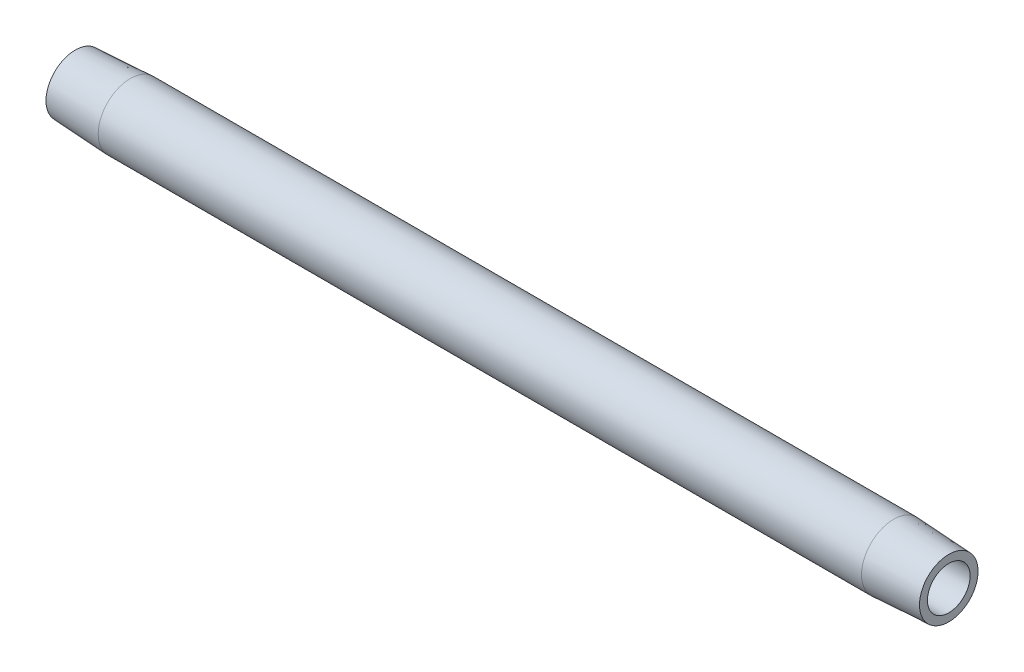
ISO-10303-21;
HEADER;
FILE_DESCRIPTION(('STEP AP214'),'2;1');
FILE_NAME('part.step','',(''),(''),'','','');
FILE_SCHEMA(('AUTOMOTIVE_DESIGN { 1 0 10303 214 1 1 1 1 }'));
ENDSEC;
DATA;
#1=APPLICATION_CONTEXT('core data for automotive mechanical design processes');
#2=APPLICATION_PROTOCOL_DEFINITION('international standard','automotive_design',2000,#1);
#3=PRODUCT_CONTEXT('',#1,'mechanical');
#4=PRODUCT('Part','Part','',(#3));
#5=PRODUCT_RELATED_PRODUCT_CATEGORY('part','',(#4));
#6=PRODUCT_DEFINITION_FORMATION('','',#4);
#7=PRODUCT_DEFINITION_CONTEXT('part definition',#1,'design');
#8=PRODUCT_DEFINITION('design','',#6,#7);
#9=PRODUCT_DEFINITION_SHAPE('','',#8);
#10=(LENGTH_UNIT() NAMED_UNIT(*) SI_UNIT(.MILLI.,.METRE.));
#11=(NAMED_UNIT(*) PLANE_ANGLE_UNIT() SI_UNIT($,.RADIAN.));
#12=(NAMED_UNIT(*) SI_UNIT($,.STERADIAN.) SOLID_ANGLE_UNIT());
#13=UNCERTAINTY_MEASURE_WITH_UNIT(LENGTH_MEASURE(1.E-05),#10,'distance_accuracy_value','');
#14=(GEOMETRIC_REPRESENTATION_CONTEXT(3) GLOBAL_UNCERTAINTY_ASSIGNED_CONTEXT((#13)) GLOBAL_UNIT_ASSIGNED_CONTEXT((#10,
#11,#12)) REPRESENTATION_CONTEXT('',''));
#15=CARTESIAN_POINT('',(0.,0.,0.));
#16=DIRECTION('',(0.,0.,1.));
#17=DIRECTION('',(1.,0.,0.));
#18=AXIS2_PLACEMENT_3D('',#15,#16,#17);
#19=CARTESIAN_POINT('',(0.476141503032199,0.,0.));
#20=DIRECTION('',(-1.,0.,0.));
#21=DIRECTION('',(0.,0.,1.));
#22=AXIS2_PLACEMENT_3D('',#19,#20,#21);
#23=CYLINDRICAL_SURFACE('',#22,5.14349999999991);
#24=CARTESIAN_POINT('',(8.8100393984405,0.,0.));
#25=DIRECTION('',(-1.,0.,0.));
#26=DIRECTION('',(0.,0.,1.));
#27=AXIS2_PLACEMENT_3D('',#24,#25,#26);
#28=CIRCLE('',#27,5.14349999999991);
#29=CARTESIAN_POINT('',(8.8100393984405,0.,5.14349999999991));
#30=VERTEX_POINT('',#29);
#31=EDGE_CURVE('E10',#30,#30,#28,.T.);
#32=ORIENTED_EDGE('',*,*,#31,.F.);
#33=EDGE_LOOP('',(#32));
#34=FACE_BOUND('',#33,.T.);
#35=CARTESIAN_POINT('',(130.889960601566,0.,0.));
#36=DIRECTION('',(-1.,0.,0.));
#37=DIRECTION('',(0.,0.,1.));
#38=AXIS2_PLACEMENT_3D('',#35,#36,#37);
#39=CIRCLE('',#38,5.14349999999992);
#40=CARTESIAN_POINT('',(130.889960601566,0.,5.14349999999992));
#41=VERTEX_POINT('',#40);
#42=EDGE_CURVE('E52',#41,#41,#39,.T.);
#43=ORIENTED_EDGE('',*,*,#42,.T.);
#44=EDGE_LOOP('',(#43));
#45=FACE_BOUND('',#44,.T.);
#46=ADVANCED_FACE('F30',(#34,#45),#23,.T.);
#47=CARTESIAN_POINT('',(8.8100393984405,0.,0.));
#48=DIRECTION('',(1.,0.,0.));
#49=DIRECTION('',(0.,0.,-1.));
#50=AXIS2_PLACEMENT_3D('',#47,#48,#49);
#51=CONICAL_SURFACE('',#50,5.14349999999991,0.0523598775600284);
#52=CARTESIAN_POINT('',(0.,0.,0.));
#53=DIRECTION('',(-1.,0.,0.));
#54=DIRECTION('',(0.,0.,1.));
#55=AXIS2_PLACEMENT_3D('',#52,#53,#54);
#56=CIRCLE('',#55,4.68178539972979);
#57=CARTESIAN_POINT('',(0.,0.,4.68178539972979));
#58=VERTEX_POINT('',#57);
#59=EDGE_CURVE('E36',#58,#58,#56,.T.);
#60=ORIENTED_EDGE('',*,*,#59,.F.);
#61=EDGE_LOOP('',(#60));
#62=FACE_BOUND('',#61,.T.);
#63=ORIENTED_EDGE('',*,*,#31,.T.);
#64=EDGE_LOOP('',(#63));
#65=FACE_BOUND('',#64,.T.);
#66=ADVANCED_FACE('F77',(#62,#65),#51,.T.);
#67=CARTESIAN_POINT('',(0.,4.68178539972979,0.));
#68=DIRECTION('',(1.,0.,0.));
#69=DIRECTION('',(0.,0.,-1.));
#70=AXIS2_PLACEMENT_3D('',#67,#68,#69);
#71=PLANE('',#70);
#72=CARTESIAN_POINT('',(0.,0.,0.));
#73=DIRECTION('',(-1.,0.,0.));
#74=DIRECTION('',(0.,0.,1.));
#75=AXIS2_PLACEMENT_3D('',#72,#73,#74);
#76=CIRCLE('',#75,3.4163);
#77=CARTESIAN_POINT('',(0.,0.,3.4163));
#78=VERTEX_POINT('',#77);
#79=EDGE_CURVE('E40',#78,#78,#76,.T.);
#80=ORIENTED_EDGE('',*,*,#79,.F.);
#81=EDGE_LOOP('',(#80));
#82=FACE_BOUND('',#81,.T.);
#83=ORIENTED_EDGE('',*,*,#59,.T.);
#84=EDGE_LOOP('',(#83));
#85=FACE_BOUND('',#84,.T.);
#86=ADVANCED_FACE('F72',(#82,#85),#71,.F.);
#87=CARTESIAN_POINT('',(0.476141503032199,0.,0.));
#88=DIRECTION('',(-1.,0.,0.));
#89=DIRECTION('',(0.,0.,1.));
#90=AXIS2_PLACEMENT_3D('',#87,#88,#89);
#91=CYLINDRICAL_SURFACE('',#90,3.4163);
#92=CARTESIAN_POINT('',(139.7,0.,0.));
#93=DIRECTION('',(-1.,0.,0.));
#94=DIRECTION('',(0.,0.,1.));
#95=AXIS2_PLACEMENT_3D('',#92,#93,#94);
#96=CIRCLE('',#95,3.4163);
#97=CARTESIAN_POINT('',(139.7,0.,3.4163));
#98=VERTEX_POINT('',#97);
#99=EDGE_CURVE('E44',#98,#98,#96,.T.);
#100=ORIENTED_EDGE('',*,*,#99,.F.);
#101=EDGE_LOOP('',(#100));
#102=FACE_BOUND('',#101,.T.);
#103=ORIENTED_EDGE('',*,*,#79,.T.);
#104=EDGE_LOOP('',(#103));
#105=FACE_BOUND('',#104,.T.);
#106=ADVANCED_FACE('F66',(#102,#105),#91,.F.);
#107=CARTESIAN_POINT('',(139.7,3.4163,0.));
#108=DIRECTION('',(-1.,0.,0.));
#109=DIRECTION('',(0.,0.,1.));
#110=AXIS2_PLACEMENT_3D('',#107,#108,#109);
#111=PLANE('',#110);
#112=CARTESIAN_POINT('',(139.7,0.,0.));
#113=DIRECTION('',(-1.,0.,0.));
#114=DIRECTION('',(0.,0.,1.));
#115=AXIS2_PLACEMENT_3D('',#112,#113,#114);
#116=CIRCLE('',#115,4.68178539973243);
#117=CARTESIAN_POINT('',(139.7,0.,4.68178539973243));
#118=VERTEX_POINT('',#117);
#119=EDGE_CURVE('E49',#118,#118,#116,.T.);
#120=ORIENTED_EDGE('',*,*,#119,.F.);
#121=EDGE_LOOP('',(#120));
#122=FACE_BOUND('',#121,.T.);
#123=ORIENTED_EDGE('',*,*,#99,.T.);
#124=EDGE_LOOP('',(#123));
#125=FACE_BOUND('',#124,.T.);
#126=ADVANCED_FACE('F60',(#122,#125),#111,.F.);
#127=CARTESIAN_POINT('',(139.7,0.,0.));
#128=DIRECTION('',(-1.,0.,0.));
#129=DIRECTION('',(0.,0.,1.));
#130=AXIS2_PLACEMENT_3D('',#127,#128,#129);
#131=CONICAL_SURFACE('',#130,4.68178539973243,0.0523598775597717);
#132=ORIENTED_EDGE('',*,*,#42,.F.);
#133=EDGE_LOOP('',(#132));
#134=FACE_BOUND('',#133,.T.);
#135=ORIENTED_EDGE('',*,*,#119,.T.);
#136=EDGE_LOOP('',(#135));
#137=FACE_BOUND('',#136,.T.);
#138=ADVANCED_FACE('F57',(#134,#137),#131,.T.);
#139=CLOSED_SHELL('',(#46,#66,#86,#106,#126,#138));
#140=MANIFOLD_SOLID_BREP('B2',#139);
#141=ADVANCED_BREP_SHAPE_REPRESENTATION('',(#18,#140),#14);
#142=SHAPE_DEFINITION_REPRESENTATION(#9,#141);
ENDSEC;
END-ISO-10303-21;
